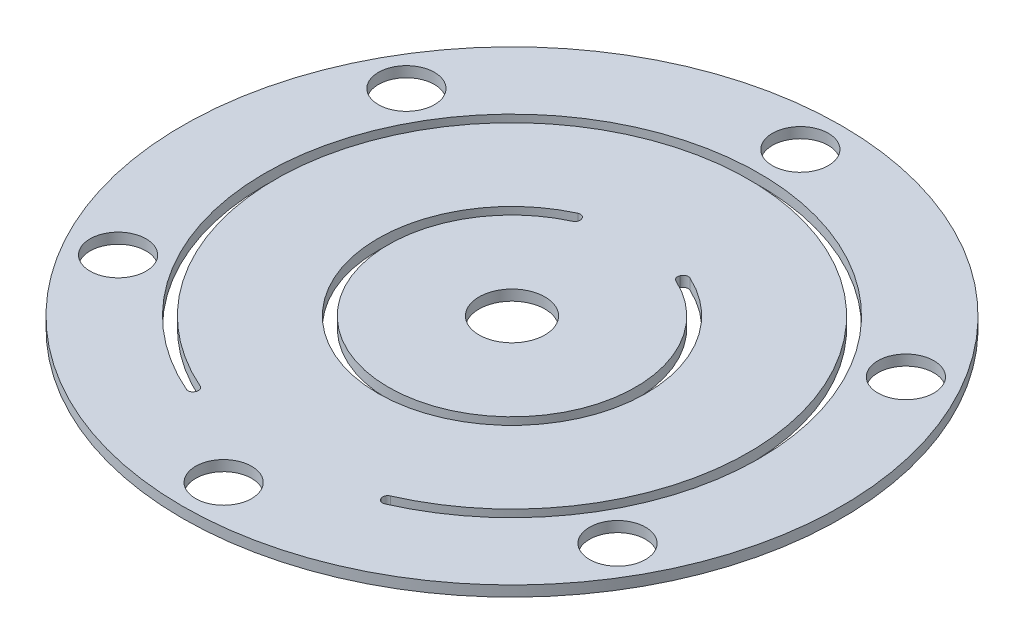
ISO-10303-21;
HEADER;
FILE_DESCRIPTION(('STEP AP214'),'2;1');
FILE_NAME('part.step','',(''),(''),'','','');
FILE_SCHEMA(('AUTOMOTIVE_DESIGN { 1 0 10303 214 1 1 1 1 }'));
ENDSEC;
DATA;
#1=APPLICATION_CONTEXT('core data for automotive mechanical design processes');
#2=APPLICATION_PROTOCOL_DEFINITION('international standard','automotive_design',2000,#1);
#3=PRODUCT_CONTEXT('',#1,'mechanical');
#4=PRODUCT('Part','Part','',(#3));
#5=PRODUCT_RELATED_PRODUCT_CATEGORY('part','',(#4));
#6=PRODUCT_DEFINITION_FORMATION('','',#4);
#7=PRODUCT_DEFINITION_CONTEXT('part definition',#1,'design');
#8=PRODUCT_DEFINITION('design','',#6,#7);
#9=PRODUCT_DEFINITION_SHAPE('','',#8);
#10=(LENGTH_UNIT() NAMED_UNIT(*) SI_UNIT(.MILLI.,.METRE.));
#11=(NAMED_UNIT(*) PLANE_ANGLE_UNIT() SI_UNIT($,.RADIAN.));
#12=(NAMED_UNIT(*) SI_UNIT($,.STERADIAN.) SOLID_ANGLE_UNIT());
#13=UNCERTAINTY_MEASURE_WITH_UNIT(LENGTH_MEASURE(1.E-05),#10,'distance_accuracy_value','');
#14=(GEOMETRIC_REPRESENTATION_CONTEXT(3) GLOBAL_UNCERTAINTY_ASSIGNED_CONTEXT((#13)) GLOBAL_UNIT_ASSIGNED_CONTEXT((#10,
#11,#12)) REPRESENTATION_CONTEXT('',''));
#15=CARTESIAN_POINT('',(0.,0.,0.));
#16=DIRECTION('',(0.,0.,1.));
#17=DIRECTION('',(1.,0.,0.));
#18=AXIS2_PLACEMENT_3D('',#15,#16,#17);
#19=CARTESIAN_POINT('',(0.,0.8128,0.));
#20=DIRECTION('',(0.,-1.,0.));
#21=DIRECTION('',(0.,0.,-1.));
#22=AXIS2_PLACEMENT_3D('',#19,#20,#21);
#23=CYLINDRICAL_SURFACE('',#22,25.4);
#24=CARTESIAN_POINT('',(0.,0.8128,0.));
#25=DIRECTION('',(0.,1.,0.));
#26=DIRECTION('',(0.,0.,1.));
#27=AXIS2_PLACEMENT_3D('',#24,#25,#26);
#28=CIRCLE('',#27,25.4);
#29=CARTESIAN_POINT('',(0.,0.8128,25.4));
#30=VERTEX_POINT('',#29);
#31=EDGE_CURVE('E395',#30,#30,#28,.T.);
#32=ORIENTED_EDGE('',*,*,#31,.F.);
#33=EDGE_LOOP('',(#32));
#34=FACE_BOUND('',#33,.T.);
#35=CARTESIAN_POINT('',(0.,0.,0.));
#36=DIRECTION('',(0.,1.,0.));
#37=DIRECTION('',(0.,0.,1.));
#38=AXIS2_PLACEMENT_3D('',#35,#36,#37);
#39=CIRCLE('',#38,25.4);
#40=CARTESIAN_POINT('',(0.,0.,25.4));
#41=VERTEX_POINT('',#40);
#42=EDGE_CURVE('E396',#41,#41,#39,.T.);
#43=ORIENTED_EDGE('',*,*,#42,.T.);
#44=EDGE_LOOP('',(#43));
#45=FACE_BOUND('',#44,.T.);
#46=ADVANCED_FACE('F44',(#34,#45),#23,.T.);
#47=CARTESIAN_POINT('',(0.,0.8128,0.));
#48=DIRECTION('',(0.,1.,0.));
#49=DIRECTION('',(0.,0.,1.));
#50=AXIS2_PLACEMENT_3D('',#47,#48,#49);
#51=PLANE('',#50);
#52=CARTESIAN_POINT('',(0.,0.8128,0.));
#53=DIRECTION('',(0.,1.,0.));
#54=DIRECTION('',(0.,0.,1.));
#55=AXIS2_PLACEMENT_3D('',#52,#53,#54);
#56=CIRCLE('',#55,19.05);
#57=CARTESIAN_POINT('',(7.64778282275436,0.8128,17.4474616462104));
#58=VERTEX_POINT('',#57);
#59=CARTESIAN_POINT('',(-7.64778282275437,0.8128,17.4474616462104));
#60=VERTEX_POINT('',#59);
#61=EDGE_CURVE('E243',#58,#60,#56,.T.);
#62=ORIENTED_EDGE('',*,*,#61,.F.);
#63=CARTESIAN_POINT('',(7.49482716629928,0.8128,17.0985124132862));
#64=DIRECTION('',(0.,1.,0.));
#65=DIRECTION('',(0.,0.,1.));
#66=AXIS2_PLACEMENT_3D('',#63,#64,#65);
#67=CIRCLE('',#66,0.381);
#68=CARTESIAN_POINT('',(7.14282906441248,0.8128,17.2443148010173));
#69=VERTEX_POINT('',#68);
#70=EDGE_CURVE('E272',#58,#69,#67,.F.);
#71=ORIENTED_EDGE('',*,*,#70,.T.);
#72=DIRECTION('',(0.382683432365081,0.,0.92387953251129));
#73=VECTOR('',#72,1.);
#74=CARTESIAN_POINT('',(7.29011938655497,0.8128,17.59990509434));
#75=LINE('',#74,#73);
#76=CARTESIAN_POINT('',(7.12338468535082,0.8128,17.1973719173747));
#77=VERTEX_POINT('',#76);
#78=EDGE_CURVE('E227',#77,#69,#75,.T.);
#79=ORIENTED_EDGE('',*,*,#78,.F.);
#80=CARTESIAN_POINT('',(7.47538278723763,0.8128,17.0515695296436));
#81=DIRECTION('',(0.,1.,0.));
#82=DIRECTION('',(0.,0.,1.));
#83=AXIS2_PLACEMENT_3D('',#80,#81,#82);
#84=CIRCLE('',#83,0.381);
#85=CARTESIAN_POINT('',(7.32240769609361,0.8128,16.702628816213));
#86=VERTEX_POINT('',#85);
#87=EDGE_CURVE('E281',#77,#86,#84,.F.);
#88=ORIENTED_EDGE('',*,*,#87,.T.);
#89=CARTESIAN_POINT('',(0.,0.8128,0.));
#90=DIRECTION('',(0.,-1.,0.));
#91=DIRECTION('',(0.,0.,1.));
#92=AXIS2_PLACEMENT_3D('',#89,#90,#91);
#93=CIRCLE('',#92,18.2372);
#94=CARTESIAN_POINT('',(-7.32240769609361,0.8128,16.702628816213));
#95=VERTEX_POINT('',#94);
#96=EDGE_CURVE('E233',#95,#86,#93,.T.);
#97=ORIENTED_EDGE('',*,*,#96,.F.);
#98=CARTESIAN_POINT('',(-7.47538278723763,0.8128,17.0515695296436));
#99=DIRECTION('',(0.,1.,0.));
#100=DIRECTION('',(0.,0.,1.));
#101=AXIS2_PLACEMENT_3D('',#98,#99,#100);
#102=CIRCLE('',#101,0.381);
#103=CARTESIAN_POINT('',(-7.12338468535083,0.8128,17.1973719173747));
#104=VERTEX_POINT('',#103);
#105=EDGE_CURVE('E286',#95,#104,#102,.F.);
#106=ORIENTED_EDGE('',*,*,#105,.T.);
#107=DIRECTION('',(0.382683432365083,0.,-0.92387953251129));
#108=VECTOR('',#107,1.);
#109=CARTESIAN_POINT('',(-7.29011938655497,0.8128,17.59990509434));
#110=LINE('',#109,#108);
#111=CARTESIAN_POINT('',(-7.14282906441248,0.8128,17.2443148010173));
#112=VERTEX_POINT('',#111);
#113=EDGE_CURVE('E240',#112,#104,#110,.T.);
#114=ORIENTED_EDGE('',*,*,#113,.F.);
#115=CARTESIAN_POINT('',(-7.49482716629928,0.8128,17.0985124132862));
#116=DIRECTION('',(0.,1.,0.));
#117=DIRECTION('',(0.,0.,1.));
#118=AXIS2_PLACEMENT_3D('',#115,#116,#117);
#119=CIRCLE('',#118,0.381);
#120=EDGE_CURVE('E52',#112,#60,#119,.F.);
#121=ORIENTED_EDGE('',*,*,#120,.T.);
#122=EDGE_LOOP('',(#62,#71,#79,#88,#97,#106,#114,#121));
#123=FACE_BOUND('',#122,.T.);
#124=CARTESIAN_POINT('',(0.,0.8128,0.));
#125=DIRECTION('',(0.,1.,0.));
#126=DIRECTION('',(0.,0.,1.));
#127=AXIS2_PLACEMENT_3D('',#124,#125,#126);
#128=CIRCLE('',#127,10.3378);
#129=CARTESIAN_POINT('',(-4.31867481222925,0.8128,-9.39250534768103));
#130=VERTEX_POINT('',#129);
#131=CARTESIAN_POINT('',(4.31867481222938,0.8128,-9.39250534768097));
#132=VERTEX_POINT('',#131);
#133=EDGE_CURVE('E214',#130,#132,#128,.T.);
#134=ORIENTED_EDGE('',*,*,#133,.F.);
#135=CARTESIAN_POINT('',(-4.15950989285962,0.8128,-9.04634421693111));
#136=DIRECTION('',(0.,1.,0.));
#137=DIRECTION('',(0.,0.,1.));
#138=AXIS2_PLACEMENT_3D('',#135,#136,#137);
#139=CIRCLE('',#138,0.381);
#140=CARTESIAN_POINT('',(-3.80751179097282,0.8128,-9.19214660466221));
#141=VERTEX_POINT('',#140);
#142=EDGE_CURVE('E185',#130,#141,#139,.F.);
#143=ORIENTED_EDGE('',*,*,#142,.T.);
#144=DIRECTION('',(-0.382683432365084,0.,-0.923879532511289));
#145=VECTOR('',#144,1.);
#146=CARTESIAN_POINT('',(-3.95610478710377,0.8128,-9.5508818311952));
#147=LINE('',#146,#145);
#148=CARTESIAN_POINT('',(-3.78805715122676,0.8128,-9.14517894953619));
#149=VERTEX_POINT('',#148);
#150=EDGE_CURVE('E175',#149,#141,#147,.T.);
#151=ORIENTED_EDGE('',*,*,#150,.F.);
#152=CARTESIAN_POINT('',(-4.14005525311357,0.8128,-8.99937656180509));
#153=DIRECTION('',(0.,1.,0.));
#154=DIRECTION('',(0.,0.,1.));
#155=AXIS2_PLACEMENT_3D('',#152,#153,#154);
#156=CIRCLE('',#155,0.381);
#157=CARTESIAN_POINT('',(-3.98082235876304,0.8128,-8.65324669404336));
#158=VERTEX_POINT('',#157);
#159=EDGE_CURVE('E157',#149,#158,#156,.F.);
#160=ORIENTED_EDGE('',*,*,#159,.T.);
#161=CARTESIAN_POINT('',(0.,0.8128,0.));
#162=DIRECTION('',(0.,-1.,0.));
#163=DIRECTION('',(0.,0.,1.));
#164=AXIS2_PLACEMENT_3D('',#161,#162,#163);
#165=CIRCLE('',#164,9.525);
#166=CARTESIAN_POINT('',(3.98082235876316,0.8128,-8.6532466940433));
#167=VERTEX_POINT('',#166);
#168=EDGE_CURVE('E188',#167,#158,#165,.T.);
#169=ORIENTED_EDGE('',*,*,#168,.F.);
#170=CARTESIAN_POINT('',(4.14005525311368,0.8128,-8.99937656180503));
#171=DIRECTION('',(0.,1.,0.));
#172=DIRECTION('',(0.,0.,1.));
#173=AXIS2_PLACEMENT_3D('',#170,#171,#172);
#174=CIRCLE('',#173,0.381);
#175=CARTESIAN_POINT('',(3.78805715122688,0.8128,-9.14517894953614));
#176=VERTEX_POINT('',#175);
#177=EDGE_CURVE('E378',#167,#176,#174,.F.);
#178=ORIENTED_EDGE('',*,*,#177,.T.);
#179=DIRECTION('',(-0.382683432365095,0.,0.923879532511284));
#180=VECTOR('',#179,1.);
#181=CARTESIAN_POINT('',(3.9561047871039,0.8128,-9.55088183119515));
#182=LINE('',#181,#180);
#183=CARTESIAN_POINT('',(3.80751179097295,0.8128,-9.19214660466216));
#184=VERTEX_POINT('',#183);
#185=EDGE_CURVE('E195',#184,#176,#182,.T.);
#186=ORIENTED_EDGE('',*,*,#185,.F.);
#187=CARTESIAN_POINT('',(4.15950989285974,0.8128,-9.04634421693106));
#188=DIRECTION('',(0.,1.,0.));
#189=DIRECTION('',(0.,0.,1.));
#190=AXIS2_PLACEMENT_3D('',#187,#188,#189);
#191=CIRCLE('',#190,0.381);
#192=EDGE_CURVE('E372',#184,#132,#191,.F.);
#193=ORIENTED_EDGE('',*,*,#192,.T.);
#194=EDGE_LOOP('',(#134,#143,#151,#160,#169,#178,#186,#193));
#195=FACE_BOUND('',#194,.T.);
#196=CARTESIAN_POINT('',(0.,0.8128,0.));
#197=DIRECTION('',(0.,1.,0.));
#198=DIRECTION('',(0.,0.,1.));
#199=AXIS2_PLACEMENT_3D('',#196,#197,#198);
#200=CIRCLE('',#199,2.54);
#201=CARTESIAN_POINT('',(0.,0.8128,2.54));
#202=VERTEX_POINT('',#201);
#203=EDGE_CURVE('E221',#202,#202,#200,.T.);
#204=ORIENTED_EDGE('',*,*,#203,.F.);
#205=EDGE_LOOP('',(#204));
#206=FACE_BOUND('',#205,.T.);
#207=CARTESIAN_POINT('',(19.2474145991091,0.8128,11.1125000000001));
#208=DIRECTION('',(0.,1.,0.));
#209=DIRECTION('',(-0.866025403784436,0.,-0.500000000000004));
#210=AXIS2_PLACEMENT_3D('',#207,#208,#209);
#211=CIRCLE('',#210,2.159);
#212=CARTESIAN_POINT('',(17.3776657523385,0.8128,10.0330000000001));
#213=VERTEX_POINT('',#212);
#214=EDGE_CURVE('E445',#213,#213,#211,.T.);
#215=ORIENTED_EDGE('',*,*,#214,.F.);
#216=EDGE_LOOP('',(#215));
#217=FACE_BOUND('',#216,.T.);
#218=CARTESIAN_POINT('',(0.,0.8128,22.225));
#219=DIRECTION('',(0.,1.,0.));
#220=DIRECTION('',(0.,0.,-1.));
#221=AXIS2_PLACEMENT_3D('',#218,#219,#220);
#222=CIRCLE('',#221,2.159);
#223=CARTESIAN_POINT('',(0.,0.8128,20.066));
#224=VERTEX_POINT('',#223);
#225=EDGE_CURVE('E438',#224,#224,#222,.T.);
#226=ORIENTED_EDGE('',*,*,#225,.F.);
#227=EDGE_LOOP('',(#226));
#228=FACE_BOUND('',#227,.T.);
#229=CARTESIAN_POINT('',(-19.2474145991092,0.8128,11.1124999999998));
#230=DIRECTION('',(0.,1.,0.));
#231=DIRECTION('',(0.866025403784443,0.,-0.499999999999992));
#232=AXIS2_PLACEMENT_3D('',#229,#230,#231);
#233=CIRCLE('',#232,2.159);
#234=CARTESIAN_POINT('',(-17.3776657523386,0.8128,10.0329999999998));
#235=VERTEX_POINT('',#234);
#236=EDGE_CURVE('E429',#235,#235,#233,.T.);
#237=ORIENTED_EDGE('',*,*,#236,.F.);
#238=EDGE_LOOP('',(#237));
#239=FACE_BOUND('',#238,.T.);
#240=CARTESIAN_POINT('',(-19.247414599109,0.8128,-11.1125000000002));
#241=DIRECTION('',(0.,1.,0.));
#242=DIRECTION('',(0.866025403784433,0.,0.50000000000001));
#243=AXIS2_PLACEMENT_3D('',#240,#241,#242);
#244=CIRCLE('',#243,2.159);
#245=CARTESIAN_POINT('',(-17.3776657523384,0.8128,-10.0330000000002));
#246=VERTEX_POINT('',#245);
#247=EDGE_CURVE('E421',#246,#246,#244,.T.);
#248=ORIENTED_EDGE('',*,*,#247,.F.);
#249=EDGE_LOOP('',(#248));
#250=FACE_BOUND('',#249,.T.);
#251=CARTESIAN_POINT('',(19.2474145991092,0.8128,-11.1125));
#252=DIRECTION('',(0.,1.,0.));
#253=DIRECTION('',(-0.86602540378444,0.,0.499999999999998));
#254=AXIS2_PLACEMENT_3D('',#251,#252,#253);
#255=CIRCLE('',#254,2.159);
#256=CARTESIAN_POINT('',(17.3776657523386,0.8128,-10.033));
#257=VERTEX_POINT('',#256);
#258=EDGE_CURVE('E414',#257,#257,#255,.T.);
#259=ORIENTED_EDGE('',*,*,#258,.F.);
#260=EDGE_LOOP('',(#259));
#261=FACE_BOUND('',#260,.T.);
#262=CARTESIAN_POINT('',(0.,0.8128,-22.225));
#263=DIRECTION('',(0.,1.,0.));
#264=DIRECTION('',(0.,0.,1.));
#265=AXIS2_PLACEMENT_3D('',#262,#263,#264);
#266=CIRCLE('',#265,2.159);
#267=CARTESIAN_POINT('',(0.,0.8128,-20.066));
#268=VERTEX_POINT('',#267);
#269=EDGE_CURVE('E403',#268,#268,#266,.T.);
#270=ORIENTED_EDGE('',*,*,#269,.F.);
#271=EDGE_LOOP('',(#270));
#272=FACE_BOUND('',#271,.T.);
#273=ORIENTED_EDGE('',*,*,#31,.T.);
#274=EDGE_LOOP('',(#273));
#275=FACE_BOUND('',#274,.T.);
#276=ADVANCED_FACE('F183',(#123,#195,#206,#217,#228,#239,#250,#261,#272,#275),#51,.T.);
#277=CARTESIAN_POINT('',(0.,0.,0.));
#278=DIRECTION('',(0.,1.,0.));
#279=DIRECTION('',(0.,0.,1.));
#280=AXIS2_PLACEMENT_3D('',#277,#278,#279);
#281=PLANE('',#280);
#282=CARTESIAN_POINT('',(0.,0.,0.));
#283=DIRECTION('',(0.,-1.,0.));
#284=DIRECTION('',(0.,0.,1.));
#285=AXIS2_PLACEMENT_3D('',#282,#283,#284);
#286=CIRCLE('',#285,18.2372);
#287=CARTESIAN_POINT('',(-7.32240769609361,0.,16.702628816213));
#288=VERTEX_POINT('',#287);
#289=CARTESIAN_POINT('',(7.32240769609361,0.,16.702628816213));
#290=VERTEX_POINT('',#289);
#291=EDGE_CURVE('E250',#288,#290,#286,.T.);
#292=ORIENTED_EDGE('',*,*,#291,.T.);
#293=CARTESIAN_POINT('',(7.47538278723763,0.,17.0515695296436));
#294=DIRECTION('',(0.,1.,0.));
#295=DIRECTION('',(0.,0.,1.));
#296=AXIS2_PLACEMENT_3D('',#293,#294,#295);
#297=CIRCLE('',#296,0.381);
#298=CARTESIAN_POINT('',(7.12338468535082,0.,17.1973719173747));
#299=VERTEX_POINT('',#298);
#300=EDGE_CURVE('E284',#290,#299,#297,.T.);
#301=ORIENTED_EDGE('',*,*,#300,.T.);
#302=DIRECTION('',(0.382683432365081,0.,0.92387953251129));
#303=VECTOR('',#302,1.);
#304=CARTESIAN_POINT('',(7.29011938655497,0.,17.59990509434));
#305=LINE('',#304,#303);
#306=CARTESIAN_POINT('',(7.14282906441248,0.,17.2443148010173));
#307=VERTEX_POINT('',#306);
#308=EDGE_CURVE('E219',#299,#307,#305,.T.);
#309=ORIENTED_EDGE('',*,*,#308,.T.);
#310=CARTESIAN_POINT('',(7.49482716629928,0.,17.0985124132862));
#311=DIRECTION('',(0.,1.,0.));
#312=DIRECTION('',(0.,0.,1.));
#313=AXIS2_PLACEMENT_3D('',#310,#311,#312);
#314=CIRCLE('',#313,0.381);
#315=CARTESIAN_POINT('',(7.64778282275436,0.,17.4474616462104));
#316=VERTEX_POINT('',#315);
#317=EDGE_CURVE('E259',#307,#316,#314,.T.);
#318=ORIENTED_EDGE('',*,*,#317,.T.);
#319=CARTESIAN_POINT('',(0.,0.,0.));
#320=DIRECTION('',(0.,1.,0.));
#321=DIRECTION('',(0.,0.,1.));
#322=AXIS2_PLACEMENT_3D('',#319,#320,#321);
#323=CIRCLE('',#322,19.05);
#324=CARTESIAN_POINT('',(-7.64778282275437,0.,17.4474616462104));
#325=VERTEX_POINT('',#324);
#326=EDGE_CURVE('E232',#316,#325,#323,.T.);
#327=ORIENTED_EDGE('',*,*,#326,.T.);
#328=CARTESIAN_POINT('',(-7.49482716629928,0.,17.0985124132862));
#329=DIRECTION('',(0.,1.,0.));
#330=DIRECTION('',(0.,0.,1.));
#331=AXIS2_PLACEMENT_3D('',#328,#329,#330);
#332=CIRCLE('',#331,0.381);
#333=CARTESIAN_POINT('',(-7.14282906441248,0.,17.2443148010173));
#334=VERTEX_POINT('',#333);
#335=EDGE_CURVE('E12',#325,#334,#332,.T.);
#336=ORIENTED_EDGE('',*,*,#335,.T.);
#337=DIRECTION('',(0.382683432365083,0.,-0.92387953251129));
#338=VECTOR('',#337,1.);
#339=CARTESIAN_POINT('',(-7.29011938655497,0.,17.59990509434));
#340=LINE('',#339,#338);
#341=CARTESIAN_POINT('',(-7.12338468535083,0.,17.1973719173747));
#342=VERTEX_POINT('',#341);
#343=EDGE_CURVE('E253',#334,#342,#340,.T.);
#344=ORIENTED_EDGE('',*,*,#343,.T.);
#345=CARTESIAN_POINT('',(-7.47538278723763,0.,17.0515695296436));
#346=DIRECTION('',(0.,1.,0.));
#347=DIRECTION('',(0.,0.,1.));
#348=AXIS2_PLACEMENT_3D('',#345,#346,#347);
#349=CIRCLE('',#348,0.381);
#350=EDGE_CURVE('E289',#342,#288,#349,.T.);
#351=ORIENTED_EDGE('',*,*,#350,.T.);
#352=EDGE_LOOP('',(#292,#301,#309,#318,#327,#336,#344,#351));
#353=FACE_BOUND('',#352,.T.);
#354=CARTESIAN_POINT('',(0.,0.,0.));
#355=DIRECTION('',(0.,-1.,0.));
#356=DIRECTION('',(0.,0.,1.));
#357=AXIS2_PLACEMENT_3D('',#354,#355,#356);
#358=CIRCLE('',#357,9.525);
#359=CARTESIAN_POINT('',(3.98082235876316,0.,-8.6532466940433));
#360=VERTEX_POINT('',#359);
#361=CARTESIAN_POINT('',(-3.98082235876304,0.,-8.65324669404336));
#362=VERTEX_POINT('',#361);
#363=EDGE_CURVE('E222',#360,#362,#358,.T.);
#364=ORIENTED_EDGE('',*,*,#363,.T.);
#365=CARTESIAN_POINT('',(-4.14005525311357,0.,-8.99937656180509));
#366=DIRECTION('',(0.,1.,0.));
#367=DIRECTION('',(0.,0.,1.));
#368=AXIS2_PLACEMENT_3D('',#365,#366,#367);
#369=CIRCLE('',#368,0.381);
#370=CARTESIAN_POINT('',(-3.78805715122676,0.,-9.14517894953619));
#371=VERTEX_POINT('',#370);
#372=EDGE_CURVE('E168',#362,#371,#369,.T.);
#373=ORIENTED_EDGE('',*,*,#372,.T.);
#374=DIRECTION('',(-0.382683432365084,0.,-0.923879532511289));
#375=VECTOR('',#374,1.);
#376=CARTESIAN_POINT('',(-3.95610478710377,0.,-9.5508818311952));
#377=LINE('',#376,#375);
#378=CARTESIAN_POINT('',(-3.80751179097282,0.,-9.19214660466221));
#379=VERTEX_POINT('',#378);
#380=EDGE_CURVE('E178',#371,#379,#377,.T.);
#381=ORIENTED_EDGE('',*,*,#380,.T.);
#382=CARTESIAN_POINT('',(-4.15950989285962,0.,-9.04634421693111));
#383=DIRECTION('',(0.,1.,0.));
#384=DIRECTION('',(0.,0.,1.));
#385=AXIS2_PLACEMENT_3D('',#382,#383,#384);
#386=CIRCLE('',#385,0.381);
#387=CARTESIAN_POINT('',(-4.31867481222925,0.,-9.39250534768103));
#388=VERTEX_POINT('',#387);
#389=EDGE_CURVE('E381',#379,#388,#386,.T.);
#390=ORIENTED_EDGE('',*,*,#389,.T.);
#391=CARTESIAN_POINT('',(0.,0.,0.));
#392=DIRECTION('',(0.,1.,0.));
#393=DIRECTION('',(0.,0.,1.));
#394=AXIS2_PLACEMENT_3D('',#391,#392,#393);
#395=CIRCLE('',#394,10.3378);
#396=CARTESIAN_POINT('',(4.31867481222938,0.,-9.39250534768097));
#397=VERTEX_POINT('',#396);
#398=EDGE_CURVE('E187',#388,#397,#395,.T.);
#399=ORIENTED_EDGE('',*,*,#398,.T.);
#400=CARTESIAN_POINT('',(4.15950989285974,0.,-9.04634421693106));
#401=DIRECTION('',(0.,1.,0.));
#402=DIRECTION('',(0.,0.,1.));
#403=AXIS2_PLACEMENT_3D('',#400,#401,#402);
#404=CIRCLE('',#403,0.381);
#405=CARTESIAN_POINT('',(3.80751179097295,0.,-9.19214660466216));
#406=VERTEX_POINT('',#405);
#407=EDGE_CURVE('E301',#397,#406,#404,.T.);
#408=ORIENTED_EDGE('',*,*,#407,.T.);
#409=DIRECTION('',(-0.382683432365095,0.,0.923879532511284));
#410=VECTOR('',#409,1.);
#411=CARTESIAN_POINT('',(3.9561047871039,0.,-9.55088183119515));
#412=LINE('',#411,#410);
#413=CARTESIAN_POINT('',(3.78805715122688,0.,-9.14517894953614));
#414=VERTEX_POINT('',#413);
#415=EDGE_CURVE('E192',#406,#414,#412,.T.);
#416=ORIENTED_EDGE('',*,*,#415,.T.);
#417=CARTESIAN_POINT('',(4.14005525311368,0.,-8.99937656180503));
#418=DIRECTION('',(0.,1.,0.));
#419=DIRECTION('',(0.,0.,1.));
#420=AXIS2_PLACEMENT_3D('',#417,#418,#419);
#421=CIRCLE('',#420,0.381);
#422=EDGE_CURVE('E374',#414,#360,#421,.T.);
#423=ORIENTED_EDGE('',*,*,#422,.T.);
#424=EDGE_LOOP('',(#364,#373,#381,#390,#399,#408,#416,#423));
#425=FACE_BOUND('',#424,.T.);
#426=CARTESIAN_POINT('',(0.,0.,0.));
#427=DIRECTION('',(0.,1.,0.));
#428=DIRECTION('',(0.,0.,1.));
#429=AXIS2_PLACEMENT_3D('',#426,#427,#428);
#430=CIRCLE('',#429,2.54);
#431=CARTESIAN_POINT('',(0.,0.,2.54));
#432=VERTEX_POINT('',#431);
#433=EDGE_CURVE('E201',#432,#432,#430,.T.);
#434=ORIENTED_EDGE('',*,*,#433,.T.);
#435=EDGE_LOOP('',(#434));
#436=FACE_BOUND('',#435,.T.);
#437=CARTESIAN_POINT('',(19.2474145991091,0.,11.1125000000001));
#438=DIRECTION('',(0.,1.,0.));
#439=DIRECTION('',(-0.866025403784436,0.,-0.500000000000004));
#440=AXIS2_PLACEMENT_3D('',#437,#438,#439);
#441=CIRCLE('',#440,2.159);
#442=CARTESIAN_POINT('',(17.3776657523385,0.,10.0330000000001));
#443=VERTEX_POINT('',#442);
#444=EDGE_CURVE('E419',#443,#443,#441,.T.);
#445=ORIENTED_EDGE('',*,*,#444,.T.);
#446=EDGE_LOOP('',(#445));
#447=FACE_BOUND('',#446,.T.);
#448=CARTESIAN_POINT('',(0.,0.,22.225));
#449=DIRECTION('',(0.,1.,0.));
#450=DIRECTION('',(0.,0.,-1.));
#451=AXIS2_PLACEMENT_3D('',#448,#449,#450);
#452=CIRCLE('',#451,2.159);
#453=CARTESIAN_POINT('',(0.,0.,20.066));
#454=VERTEX_POINT('',#453);
#455=EDGE_CURVE('E443',#454,#454,#452,.T.);
#456=ORIENTED_EDGE('',*,*,#455,.T.);
#457=EDGE_LOOP('',(#456));
#458=FACE_BOUND('',#457,.T.);
#459=CARTESIAN_POINT('',(-19.2474145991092,0.,11.1124999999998));
#460=DIRECTION('',(0.,1.,0.));
#461=DIRECTION('',(0.866025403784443,0.,-0.499999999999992));
#462=AXIS2_PLACEMENT_3D('',#459,#460,#461);
#463=CIRCLE('',#462,2.159);
#464=CARTESIAN_POINT('',(-17.3776657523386,0.,10.0329999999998));
#465=VERTEX_POINT('',#464);
#466=EDGE_CURVE('E434',#465,#465,#463,.T.);
#467=ORIENTED_EDGE('',*,*,#466,.T.);
#468=EDGE_LOOP('',(#467));
#469=FACE_BOUND('',#468,.T.);
#470=CARTESIAN_POINT('',(-19.247414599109,0.,-11.1125000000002));
#471=DIRECTION('',(0.,1.,0.));
#472=DIRECTION('',(0.866025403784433,0.,0.50000000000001));
#473=AXIS2_PLACEMENT_3D('',#470,#471,#472);
#474=CIRCLE('',#473,2.159);
#475=CARTESIAN_POINT('',(-17.3776657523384,0.,-10.0330000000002));
#476=VERTEX_POINT('',#475);
#477=EDGE_CURVE('E426',#476,#476,#474,.T.);
#478=ORIENTED_EDGE('',*,*,#477,.T.);
#479=EDGE_LOOP('',(#478));
#480=FACE_BOUND('',#479,.T.);
#481=CARTESIAN_POINT('',(19.2474145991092,0.,-11.1125));
#482=DIRECTION('',(0.,1.,0.));
#483=DIRECTION('',(-0.86602540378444,0.,0.499999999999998));
#484=AXIS2_PLACEMENT_3D('',#481,#482,#483);
#485=CIRCLE('',#484,2.159);
#486=CARTESIAN_POINT('',(17.3776657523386,0.,-10.033));
#487=VERTEX_POINT('',#486);
#488=EDGE_CURVE('E408',#487,#487,#485,.T.);
#489=ORIENTED_EDGE('',*,*,#488,.T.);
#490=EDGE_LOOP('',(#489));
#491=FACE_BOUND('',#490,.T.);
#492=CARTESIAN_POINT('',(0.,0.,-22.225));
#493=DIRECTION('',(0.,1.,0.));
#494=DIRECTION('',(0.,0.,1.));
#495=AXIS2_PLACEMENT_3D('',#492,#493,#494);
#496=CIRCLE('',#495,2.159);
#497=CARTESIAN_POINT('',(0.,0.,-20.066));
#498=VERTEX_POINT('',#497);
#499=EDGE_CURVE('E398',#498,#498,#496,.T.);
#500=ORIENTED_EDGE('',*,*,#499,.T.);
#501=EDGE_LOOP('',(#500));
#502=FACE_BOUND('',#501,.T.);
#503=ORIENTED_EDGE('',*,*,#42,.F.);
#504=EDGE_LOOP('',(#503));
#505=FACE_BOUND('',#504,.T.);
#506=ADVANCED_FACE('F256',(#353,#425,#436,#447,#458,#469,#480,#491,#502,#505),#281,.F.);
#507=CARTESIAN_POINT('',(0.,0.,-22.225));
#508=DIRECTION('',(0.,1.,0.));
#509=DIRECTION('',(0.,0.,1.));
#510=AXIS2_PLACEMENT_3D('',#507,#508,#509);
#511=CYLINDRICAL_SURFACE('',#510,2.159);
#512=ORIENTED_EDGE('',*,*,#499,.F.);
#513=EDGE_LOOP('',(#512));
#514=FACE_BOUND('',#513,.T.);
#515=ORIENTED_EDGE('',*,*,#269,.T.);
#516=EDGE_LOOP('',(#515));
#517=FACE_BOUND('',#516,.T.);
#518=ADVANCED_FACE('F491',(#514,#517),#511,.F.);
#519=CARTESIAN_POINT('',(19.2474145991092,0.,-11.1125));
#520=DIRECTION('',(0.,1.,0.));
#521=DIRECTION('',(0.,0.,1.));
#522=AXIS2_PLACEMENT_3D('',#519,#520,#521);
#523=CYLINDRICAL_SURFACE('',#522,2.159);
#524=ORIENTED_EDGE('',*,*,#488,.F.);
#525=EDGE_LOOP('',(#524));
#526=FACE_BOUND('',#525,.T.);
#527=ORIENTED_EDGE('',*,*,#258,.T.);
#528=EDGE_LOOP('',(#527));
#529=FACE_BOUND('',#528,.T.);
#530=ADVANCED_FACE('F487',(#526,#529),#523,.F.);
#531=CARTESIAN_POINT('',(-19.247414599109,0.,-11.1125000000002));
#532=DIRECTION('',(0.,1.,0.));
#533=DIRECTION('',(0.,0.,1.));
#534=AXIS2_PLACEMENT_3D('',#531,#532,#533);
#535=CYLINDRICAL_SURFACE('',#534,2.159);
#536=ORIENTED_EDGE('',*,*,#477,.F.);
#537=EDGE_LOOP('',(#536));
#538=FACE_BOUND('',#537,.T.);
#539=ORIENTED_EDGE('',*,*,#247,.T.);
#540=EDGE_LOOP('',(#539));
#541=FACE_BOUND('',#540,.T.);
#542=ADVANCED_FACE('F483',(#538,#541),#535,.F.);
#543=CARTESIAN_POINT('',(-19.2474145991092,0.,11.1124999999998));
#544=DIRECTION('',(0.,1.,0.));
#545=DIRECTION('',(0.,0.,1.));
#546=AXIS2_PLACEMENT_3D('',#543,#544,#545);
#547=CYLINDRICAL_SURFACE('',#546,2.159);
#548=ORIENTED_EDGE('',*,*,#466,.F.);
#549=EDGE_LOOP('',(#548));
#550=FACE_BOUND('',#549,.T.);
#551=ORIENTED_EDGE('',*,*,#236,.T.);
#552=EDGE_LOOP('',(#551));
#553=FACE_BOUND('',#552,.T.);
#554=ADVANCED_FACE('F479',(#550,#553),#547,.F.);
#555=CARTESIAN_POINT('',(0.,0.,22.225));
#556=DIRECTION('',(0.,1.,0.));
#557=DIRECTION('',(0.,0.,1.));
#558=AXIS2_PLACEMENT_3D('',#555,#556,#557);
#559=CYLINDRICAL_SURFACE('',#558,2.159);
#560=ORIENTED_EDGE('',*,*,#455,.F.);
#561=EDGE_LOOP('',(#560));
#562=FACE_BOUND('',#561,.T.);
#563=ORIENTED_EDGE('',*,*,#225,.T.);
#564=EDGE_LOOP('',(#563));
#565=FACE_BOUND('',#564,.T.);
#566=ADVANCED_FACE('F472',(#562,#565),#559,.F.);
#567=CARTESIAN_POINT('',(19.2474145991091,0.,11.1125000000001));
#568=DIRECTION('',(0.,1.,0.));
#569=DIRECTION('',(0.,0.,1.));
#570=AXIS2_PLACEMENT_3D('',#567,#568,#569);
#571=CYLINDRICAL_SURFACE('',#570,2.159);
#572=ORIENTED_EDGE('',*,*,#444,.F.);
#573=EDGE_LOOP('',(#572));
#574=FACE_BOUND('',#573,.T.);
#575=ORIENTED_EDGE('',*,*,#214,.T.);
#576=EDGE_LOOP('',(#575));
#577=FACE_BOUND('',#576,.T.);
#578=ADVANCED_FACE('F464',(#574,#577),#571,.F.);
#579=CARTESIAN_POINT('',(0.,0.,0.));
#580=DIRECTION('',(0.,1.,0.));
#581=DIRECTION('',(0.,0.,1.));
#582=AXIS2_PLACEMENT_3D('',#579,#580,#581);
#583=CYLINDRICAL_SURFACE('',#582,2.54);
#584=ORIENTED_EDGE('',*,*,#433,.F.);
#585=EDGE_LOOP('',(#584));
#586=FACE_BOUND('',#585,.T.);
#587=ORIENTED_EDGE('',*,*,#203,.T.);
#588=EDGE_LOOP('',(#587));
#589=FACE_BOUND('',#588,.T.);
#590=ADVANCED_FACE('F461',(#586,#589),#583,.F.);
#591=CARTESIAN_POINT('',(0.,0.,0.));
#592=DIRECTION('',(0.,1.,0.));
#593=DIRECTION('',(0.,0.,1.));
#594=AXIS2_PLACEMENT_3D('',#591,#592,#593);
#595=CYLINDRICAL_SURFACE('',#594,10.3378);
#596=ORIENTED_EDGE('',*,*,#398,.F.);
#597=DIRECTION('',(0.,1.,0.));
#598=VECTOR('',#597,1.);
#599=CARTESIAN_POINT('',(-4.31867481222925,0.,-9.39250534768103));
#600=LINE('',#599,#598);
#601=EDGE_CURVE('E387',#388,#130,#600,.T.);
#602=ORIENTED_EDGE('',*,*,#601,.T.);
#603=ORIENTED_EDGE('',*,*,#133,.T.);
#604=DIRECTION('',(0.,1.,0.));
#605=VECTOR('',#604,1.);
#606=CARTESIAN_POINT('',(4.31867481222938,0.,-9.39250534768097));
#607=LINE('',#606,#605);
#608=EDGE_CURVE('E368',#132,#397,#607,.F.);
#609=ORIENTED_EDGE('',*,*,#608,.T.);
#610=EDGE_LOOP('',(#596,#602,#603,#609));
#611=FACE_BOUND('',#610,.T.);
#612=ADVANCED_FACE('F463',(#611),#595,.F.);
#613=CARTESIAN_POINT('',(-3.95610478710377,0.,-9.5508818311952));
#614=DIRECTION('',(0.923879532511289,0.,-0.382683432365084));
#615=DIRECTION('',(-0.382683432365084,0.,-0.923879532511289));
#616=AXIS2_PLACEMENT_3D('',#613,#614,#615);
#617=PLANE('',#616);
#618=ORIENTED_EDGE('',*,*,#380,.F.);
#619=DIRECTION('',(0.,-1.,0.));
#620=VECTOR('',#619,1.);
#621=CARTESIAN_POINT('',(-3.78805715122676,0.8128,-9.14517894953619));
#622=LINE('',#621,#620);
#623=EDGE_CURVE('E161',#371,#149,#622,.F.);
#624=ORIENTED_EDGE('',*,*,#623,.T.);
#625=ORIENTED_EDGE('',*,*,#150,.T.);
#626=DIRECTION('',(0.,-1.,0.));
#627=VECTOR('',#626,1.);
#628=CARTESIAN_POINT('',(-3.80751179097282,0.,-9.19214660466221));
#629=LINE('',#628,#627);
#630=EDGE_CURVE('E180',#141,#379,#629,.T.);
#631=ORIENTED_EDGE('',*,*,#630,.T.);
#632=EDGE_LOOP('',(#618,#624,#625,#631));
#633=FACE_BOUND('',#632,.T.);
#634=ADVANCED_FACE('F174',(#633),#617,.F.);
#635=CARTESIAN_POINT('',(0.,0.,0.));
#636=DIRECTION('',(0.,1.,0.));
#637=DIRECTION('',(0.,0.,1.));
#638=AXIS2_PLACEMENT_3D('',#635,#636,#637);
#639=CYLINDRICAL_SURFACE('',#638,9.525);
#640=ORIENTED_EDGE('',*,*,#168,.T.);
#641=DIRECTION('',(0.,1.,0.));
#642=VECTOR('',#641,1.);
#643=CARTESIAN_POINT('',(-3.98082235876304,0.,-8.65324669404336));
#644=LINE('',#643,#642);
#645=EDGE_CURVE('E162',#158,#362,#644,.F.);
#646=ORIENTED_EDGE('',*,*,#645,.T.);
#647=ORIENTED_EDGE('',*,*,#363,.F.);
#648=DIRECTION('',(0.,1.,0.));
#649=VECTOR('',#648,1.);
#650=CARTESIAN_POINT('',(3.98082235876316,0.,-8.6532466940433));
#651=LINE('',#650,#649);
#652=EDGE_CURVE('E179',#360,#167,#651,.T.);
#653=ORIENTED_EDGE('',*,*,#652,.T.);
#654=EDGE_LOOP('',(#640,#646,#647,#653));
#655=FACE_BOUND('',#654,.T.);
#656=ADVANCED_FACE('F547',(#655),#639,.T.);
#657=CARTESIAN_POINT('',(3.9561047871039,0.,-9.55088183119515));
#658=DIRECTION('',(-0.923879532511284,0.,-0.382683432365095));
#659=DIRECTION('',(-0.382683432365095,0.,0.923879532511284));
#660=AXIS2_PLACEMENT_3D('',#657,#658,#659);
#661=PLANE('',#660);
#662=ORIENTED_EDGE('',*,*,#185,.T.);
#663=DIRECTION('',(0.,-1.,0.));
#664=VECTOR('',#663,1.);
#665=CARTESIAN_POINT('',(3.78805715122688,0.,-9.14517894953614));
#666=LINE('',#665,#664);
#667=EDGE_CURVE('E169',#176,#414,#666,.T.);
#668=ORIENTED_EDGE('',*,*,#667,.T.);
#669=ORIENTED_EDGE('',*,*,#415,.F.);
#670=DIRECTION('',(0.,-1.,0.));
#671=VECTOR('',#670,1.);
#672=CARTESIAN_POINT('',(3.80751179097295,0.8128,-9.19214660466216));
#673=LINE('',#672,#671);
#674=EDGE_CURVE('E370',#406,#184,#673,.F.);
#675=ORIENTED_EDGE('',*,*,#674,.T.);
#676=EDGE_LOOP('',(#662,#668,#669,#675));
#677=FACE_BOUND('',#676,.T.);
#678=ADVANCED_FACE('F351',(#677),#661,.F.);
#679=CARTESIAN_POINT('',(-4.14005525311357,0.,-8.99937656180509));
#680=DIRECTION('',(0.,1.,0.));
#681=DIRECTION('',(0.,0.,1.));
#682=AXIS2_PLACEMENT_3D('',#679,#680,#681);
#683=CYLINDRICAL_SURFACE('',#682,0.381);
#684=ORIENTED_EDGE('',*,*,#372,.F.);
#685=ORIENTED_EDGE('',*,*,#645,.F.);
#686=ORIENTED_EDGE('',*,*,#159,.F.);
#687=ORIENTED_EDGE('',*,*,#623,.F.);
#688=EDGE_LOOP('',(#684,#685,#686,#687));
#689=FACE_BOUND('',#688,.T.);
#690=ADVANCED_FACE('F160',(#689),#683,.F.);
#691=CARTESIAN_POINT('',(-4.15950989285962,0.,-9.04634421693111));
#692=DIRECTION('',(0.,1.,0.));
#693=DIRECTION('',(0.,0.,1.));
#694=AXIS2_PLACEMENT_3D('',#691,#692,#693);
#695=CYLINDRICAL_SURFACE('',#694,0.381);
#696=ORIENTED_EDGE('',*,*,#389,.F.);
#697=ORIENTED_EDGE('',*,*,#630,.F.);
#698=ORIENTED_EDGE('',*,*,#142,.F.);
#699=ORIENTED_EDGE('',*,*,#601,.F.);
#700=EDGE_LOOP('',(#696,#697,#698,#699));
#701=FACE_BOUND('',#700,.T.);
#702=ADVANCED_FACE('F350',(#701),#695,.F.);
#703=CARTESIAN_POINT('',(4.14005525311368,0.,-8.99937656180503));
#704=DIRECTION('',(0.,1.,0.));
#705=DIRECTION('',(0.,0.,1.));
#706=AXIS2_PLACEMENT_3D('',#703,#704,#705);
#707=CYLINDRICAL_SURFACE('',#706,0.381);
#708=ORIENTED_EDGE('',*,*,#422,.F.);
#709=ORIENTED_EDGE('',*,*,#667,.F.);
#710=ORIENTED_EDGE('',*,*,#177,.F.);
#711=ORIENTED_EDGE('',*,*,#652,.F.);
#712=EDGE_LOOP('',(#708,#709,#710,#711));
#713=FACE_BOUND('',#712,.T.);
#714=ADVANCED_FACE('F354',(#713),#707,.F.);
#715=CARTESIAN_POINT('',(4.15950989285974,0.,-9.04634421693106));
#716=DIRECTION('',(0.,1.,0.));
#717=DIRECTION('',(0.,0.,1.));
#718=AXIS2_PLACEMENT_3D('',#715,#716,#717);
#719=CYLINDRICAL_SURFACE('',#718,0.381);
#720=ORIENTED_EDGE('',*,*,#407,.F.);
#721=ORIENTED_EDGE('',*,*,#608,.F.);
#722=ORIENTED_EDGE('',*,*,#192,.F.);
#723=ORIENTED_EDGE('',*,*,#674,.F.);
#724=EDGE_LOOP('',(#720,#721,#722,#723));
#725=FACE_BOUND('',#724,.T.);
#726=ADVANCED_FACE('F357',(#725),#719,.F.);
#727=CARTESIAN_POINT('',(0.,0.,0.));
#728=DIRECTION('',(0.,1.,0.));
#729=DIRECTION('',(0.,0.,1.));
#730=AXIS2_PLACEMENT_3D('',#727,#728,#729);
#731=CYLINDRICAL_SURFACE('',#730,19.05);
#732=ORIENTED_EDGE('',*,*,#326,.F.);
#733=DIRECTION('',(0.,1.,0.));
#734=VECTOR('',#733,1.);
#735=CARTESIAN_POINT('',(7.64778282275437,0.,17.4474616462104));
#736=LINE('',#735,#734);
#737=EDGE_CURVE('E294',#316,#58,#736,.T.);
#738=ORIENTED_EDGE('',*,*,#737,.T.);
#739=ORIENTED_EDGE('',*,*,#61,.T.);
#740=DIRECTION('',(0.,1.,0.));
#741=VECTOR('',#740,1.);
#742=CARTESIAN_POINT('',(-7.64778282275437,0.,17.4474616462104));
#743=LINE('',#742,#741);
#744=EDGE_CURVE('E266',#60,#325,#743,.F.);
#745=ORIENTED_EDGE('',*,*,#744,.T.);
#746=EDGE_LOOP('',(#732,#738,#739,#745));
#747=FACE_BOUND('',#746,.T.);
#748=ADVANCED_FACE('F293',(#747),#731,.F.);
#749=CARTESIAN_POINT('',(7.29011938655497,0.,17.59990509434));
#750=DIRECTION('',(-0.92387953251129,0.,0.382683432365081));
#751=DIRECTION('',(0.382683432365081,0.,0.923879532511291));
#752=AXIS2_PLACEMENT_3D('',#749,#750,#751);
#753=PLANE('',#752);
#754=ORIENTED_EDGE('',*,*,#78,.T.);
#755=DIRECTION('',(0.,-1.,0.));
#756=VECTOR('',#755,1.);
#757=CARTESIAN_POINT('',(7.14282906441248,0.,17.2443148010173));
#758=LINE('',#757,#756);
#759=EDGE_CURVE('E299',#69,#307,#758,.T.);
#760=ORIENTED_EDGE('',*,*,#759,.T.);
#761=ORIENTED_EDGE('',*,*,#308,.F.);
#762=DIRECTION('',(0.,-1.,0.));
#763=VECTOR('',#762,1.);
#764=CARTESIAN_POINT('',(7.12338468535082,0.8128,17.1973719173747));
#765=LINE('',#764,#763);
#766=EDGE_CURVE('E296',#299,#77,#765,.F.);
#767=ORIENTED_EDGE('',*,*,#766,.T.);
#768=EDGE_LOOP('',(#754,#760,#761,#767));
#769=FACE_BOUND('',#768,.T.);
#770=ADVANCED_FACE('F323',(#769),#753,.F.);
#771=CARTESIAN_POINT('',(0.,0.,0.));
#772=DIRECTION('',(0.,1.,0.));
#773=DIRECTION('',(0.,0.,1.));
#774=AXIS2_PLACEMENT_3D('',#771,#772,#773);
#775=CYLINDRICAL_SURFACE('',#774,18.2372);
#776=ORIENTED_EDGE('',*,*,#96,.T.);
#777=DIRECTION('',(0.,1.,0.));
#778=VECTOR('',#777,1.);
#779=CARTESIAN_POINT('',(7.32240769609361,0.,16.702628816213));
#780=LINE('',#779,#778);
#781=EDGE_CURVE('E270',#86,#290,#780,.F.);
#782=ORIENTED_EDGE('',*,*,#781,.T.);
#783=ORIENTED_EDGE('',*,*,#291,.F.);
#784=DIRECTION('',(0.,1.,0.));
#785=VECTOR('',#784,1.);
#786=CARTESIAN_POINT('',(-7.32240769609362,0.,16.702628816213));
#787=LINE('',#786,#785);
#788=EDGE_CURVE('E274',#288,#95,#787,.T.);
#789=ORIENTED_EDGE('',*,*,#788,.T.);
#790=EDGE_LOOP('',(#776,#782,#783,#789));
#791=FACE_BOUND('',#790,.T.);
#792=ADVANCED_FACE('F311',(#791),#775,.T.);
#793=CARTESIAN_POINT('',(-7.29011938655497,0.,17.59990509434));
#794=DIRECTION('',(0.923879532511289,0.,0.382683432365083));
#795=DIRECTION('',(0.382683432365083,0.,-0.92387953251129));
#796=AXIS2_PLACEMENT_3D('',#793,#794,#795);
#797=PLANE('',#796);
#798=ORIENTED_EDGE('',*,*,#113,.T.);
#799=DIRECTION('',(0.,-1.,0.));
#800=VECTOR('',#799,1.);
#801=CARTESIAN_POINT('',(-7.12338468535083,0.,17.1973719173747));
#802=LINE('',#801,#800);
#803=EDGE_CURVE('E59',#104,#342,#802,.T.);
#804=ORIENTED_EDGE('',*,*,#803,.T.);
#805=ORIENTED_EDGE('',*,*,#343,.F.);
#806=DIRECTION('',(0.,-1.,0.));
#807=VECTOR('',#806,1.);
#808=CARTESIAN_POINT('',(-7.14282906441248,0.8128,17.2443148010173));
#809=LINE('',#808,#807);
#810=EDGE_CURVE('E268',#334,#112,#809,.F.);
#811=ORIENTED_EDGE('',*,*,#810,.T.);
#812=EDGE_LOOP('',(#798,#804,#805,#811));
#813=FACE_BOUND('',#812,.T.);
#814=ADVANCED_FACE('F327',(#813),#797,.F.);
#815=CARTESIAN_POINT('',(7.49482716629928,0.,17.0985124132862));
#816=DIRECTION('',(0.,1.,0.));
#817=DIRECTION('',(0.,0.,1.));
#818=AXIS2_PLACEMENT_3D('',#815,#816,#817);
#819=CYLINDRICAL_SURFACE('',#818,0.381);
#820=ORIENTED_EDGE('',*,*,#317,.F.);
#821=ORIENTED_EDGE('',*,*,#759,.F.);
#822=ORIENTED_EDGE('',*,*,#70,.F.);
#823=ORIENTED_EDGE('',*,*,#737,.F.);
#824=EDGE_LOOP('',(#820,#821,#822,#823));
#825=FACE_BOUND('',#824,.T.);
#826=ADVANCED_FACE('F325',(#825),#819,.F.);
#827=CARTESIAN_POINT('',(7.47538278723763,0.,17.0515695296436));
#828=DIRECTION('',(0.,1.,0.));
#829=DIRECTION('',(0.,0.,1.));
#830=AXIS2_PLACEMENT_3D('',#827,#828,#829);
#831=CYLINDRICAL_SURFACE('',#830,0.381);
#832=ORIENTED_EDGE('',*,*,#300,.F.);
#833=ORIENTED_EDGE('',*,*,#781,.F.);
#834=ORIENTED_EDGE('',*,*,#87,.F.);
#835=ORIENTED_EDGE('',*,*,#766,.F.);
#836=EDGE_LOOP('',(#832,#833,#834,#835));
#837=FACE_BOUND('',#836,.T.);
#838=ADVANCED_FACE('F320',(#837),#831,.F.);
#839=CARTESIAN_POINT('',(-7.47538278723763,0.,17.0515695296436));
#840=DIRECTION('',(0.,1.,0.));
#841=DIRECTION('',(0.,0.,1.));
#842=AXIS2_PLACEMENT_3D('',#839,#840,#841);
#843=CYLINDRICAL_SURFACE('',#842,0.381);
#844=ORIENTED_EDGE('',*,*,#350,.F.);
#845=ORIENTED_EDGE('',*,*,#803,.F.);
#846=ORIENTED_EDGE('',*,*,#105,.F.);
#847=ORIENTED_EDGE('',*,*,#788,.F.);
#848=EDGE_LOOP('',(#844,#845,#846,#847));
#849=FACE_BOUND('',#848,.T.);
#850=ADVANCED_FACE('F333',(#849),#843,.F.);
#851=CARTESIAN_POINT('',(-7.49482716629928,0.,17.0985124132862));
#852=DIRECTION('',(0.,1.,0.));
#853=DIRECTION('',(0.,0.,1.));
#854=AXIS2_PLACEMENT_3D('',#851,#852,#853);
#855=CYLINDRICAL_SURFACE('',#854,0.381);
#856=ORIENTED_EDGE('',*,*,#335,.F.);
#857=ORIENTED_EDGE('',*,*,#744,.F.);
#858=ORIENTED_EDGE('',*,*,#120,.F.);
#859=ORIENTED_EDGE('',*,*,#810,.F.);
#860=EDGE_LOOP('',(#856,#857,#858,#859));
#861=FACE_BOUND('',#860,.T.);
#862=ADVANCED_FACE('F46',(#861),#855,.F.);
#863=CLOSED_SHELL('',(#46,#276,#506,#518,#530,#542,#554,#566,#578,#590,#612,#634,#656,#678,#690,
#702,#714,#726,#748,#770,#792,#814,#826,#838,#850,#862));
#864=MANIFOLD_SOLID_BREP('B2',#863);
#865=ADVANCED_BREP_SHAPE_REPRESENTATION('',(#18,#864),#14);
#866=SHAPE_DEFINITION_REPRESENTATION(#9,#865);
ENDSEC;
END-ISO-10303-21;
